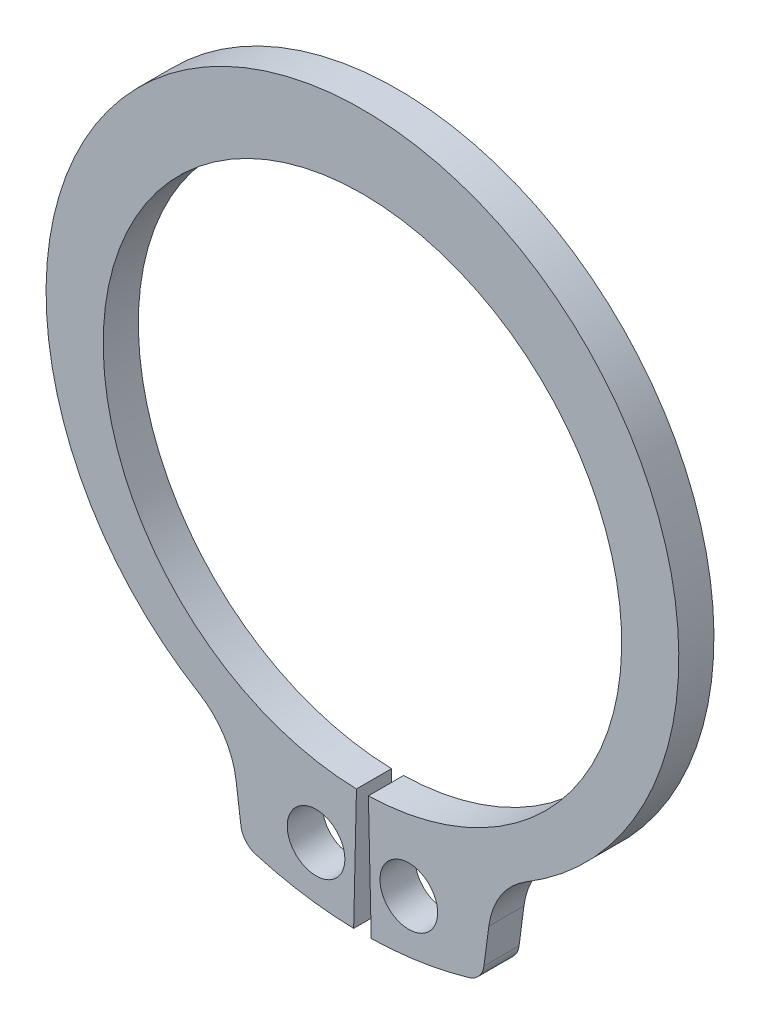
ISO-10303-21;
HEADER;
FILE_DESCRIPTION(('STEP AP214'),'2;1');
FILE_NAME('part.step','',(''),(''),'','','');
FILE_SCHEMA(('AUTOMOTIVE_DESIGN { 1 0 10303 214 1 1 1 1 }'));
ENDSEC;
DATA;
#1=APPLICATION_CONTEXT('core data for automotive mechanical design processes');
#2=APPLICATION_PROTOCOL_DEFINITION('international standard','automotive_design',2000,#1);
#3=PRODUCT_CONTEXT('',#1,'mechanical');
#4=PRODUCT('Part','Part','',(#3));
#5=PRODUCT_RELATED_PRODUCT_CATEGORY('part','',(#4));
#6=PRODUCT_DEFINITION_FORMATION('','',#4);
#7=PRODUCT_DEFINITION_CONTEXT('part definition',#1,'design');
#8=PRODUCT_DEFINITION('design','',#6,#7);
#9=PRODUCT_DEFINITION_SHAPE('','',#8);
#10=(LENGTH_UNIT() NAMED_UNIT(*) SI_UNIT(.MILLI.,.METRE.));
#11=(NAMED_UNIT(*) PLANE_ANGLE_UNIT() SI_UNIT($,.RADIAN.));
#12=(NAMED_UNIT(*) SI_UNIT($,.STERADIAN.) SOLID_ANGLE_UNIT());
#13=UNCERTAINTY_MEASURE_WITH_UNIT(LENGTH_MEASURE(1.E-05),#10,'distance_accuracy_value','');
#14=(GEOMETRIC_REPRESENTATION_CONTEXT(3) GLOBAL_UNCERTAINTY_ASSIGNED_CONTEXT((#13)) GLOBAL_UNIT_ASSIGNED_CONTEXT((#10,
#11,#12)) REPRESENTATION_CONTEXT('',''));
#15=CARTESIAN_POINT('',(0.,0.,0.));
#16=DIRECTION('',(0.,0.,1.));
#17=DIRECTION('',(1.,0.,0.));
#18=AXIS2_PLACEMENT_3D('',#15,#16,#17);
#19=CARTESIAN_POINT('',(0.,0.,-0.635));
#20=DIRECTION('',(0.,0.,1.));
#21=DIRECTION('',(1.,0.,0.));
#22=AXIS2_PLACEMENT_3D('',#19,#20,#21);
#23=CYLINDRICAL_SURFACE('',#22,4.6863);
#24=CARTESIAN_POINT('',(0.,0.,0.));
#25=DIRECTION('',(0.,0.,-1.));
#26=DIRECTION('',(1.,0.,0.));
#27=AXIS2_PLACEMENT_3D('',#24,#25,#26);
#28=CIRCLE('',#27,4.6863);
#29=CARTESIAN_POINT('',(-0.107879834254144,-4.68505812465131,0.));
#30=VERTEX_POINT('',#29);
#31=CARTESIAN_POINT('',(0.107879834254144,-4.68505812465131,0.));
#32=VERTEX_POINT('',#31);
#33=EDGE_CURVE('E151',#30,#32,#28,.T.);
#34=ORIENTED_EDGE('',*,*,#33,.F.);
#35=DIRECTION('',(0.,0.,1.));
#36=VECTOR('',#35,1.);
#37=CARTESIAN_POINT('',(-0.107879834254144,-4.68505812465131,-0.635));
#38=LINE('',#37,#36);
#39=CARTESIAN_POINT('',(-0.107879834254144,-4.68505812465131,-0.635));
#40=VERTEX_POINT('',#39);
#41=EDGE_CURVE('E11',#40,#30,#38,.T.);
#42=ORIENTED_EDGE('',*,*,#41,.F.);
#43=CARTESIAN_POINT('',(0.,0.,-0.635));
#44=DIRECTION('',(0.,0.,-1.));
#45=DIRECTION('',(1.,0.,0.));
#46=AXIS2_PLACEMENT_3D('',#43,#44,#45);
#47=CIRCLE('',#46,4.6863);
#48=CARTESIAN_POINT('',(0.107879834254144,-4.68505812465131,-0.635));
#49=VERTEX_POINT('',#48);
#50=EDGE_CURVE('E184',#40,#49,#47,.T.);
#51=ORIENTED_EDGE('',*,*,#50,.T.);
#52=DIRECTION('',(0.,0.,1.));
#53=VECTOR('',#52,1.);
#54=CARTESIAN_POINT('',(0.107879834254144,-4.68505812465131,-0.635));
#55=LINE('',#54,#53);
#56=EDGE_CURVE('E33',#49,#32,#55,.T.);
#57=ORIENTED_EDGE('',*,*,#56,.T.);
#58=EDGE_LOOP('',(#34,#42,#51,#57));
#59=FACE_BOUND('',#58,.T.);
#60=ADVANCED_FACE('F30',(#59),#23,.F.);
#61=CARTESIAN_POINT('',(-0.107879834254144,-4.68505812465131,-0.635));
#62=DIRECTION('',(0.999734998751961,-0.0230202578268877,0.));
#63=DIRECTION('',(0.0230202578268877,0.999734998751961,0.));
#64=AXIS2_PLACEMENT_3D('',#61,#62,#63);
#65=PLANE('',#64);
#66=DIRECTION('',(0.0230202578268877,0.999734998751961,0.));
#67=VECTOR('',#66,1.);
#68=CARTESIAN_POINT('',(-0.107879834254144,-4.68505812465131,0.));
#69=LINE('',#68,#67);
#70=CARTESIAN_POINT('',(-0.15875,-6.8942725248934,0.));
#71=VERTEX_POINT('',#70);
#72=EDGE_CURVE('E182',#71,#30,#69,.T.);
#73=ORIENTED_EDGE('',*,*,#72,.F.);
#74=DIRECTION('',(0.,0.,1.));
#75=VECTOR('',#74,1.);
#76=CARTESIAN_POINT('',(-0.15875,-6.8942725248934,-0.635));
#77=LINE('',#76,#75);
#78=CARTESIAN_POINT('',(-0.15875,-6.8942725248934,-0.635));
#79=VERTEX_POINT('',#78);
#80=EDGE_CURVE('E39',#79,#71,#77,.T.);
#81=ORIENTED_EDGE('',*,*,#80,.F.);
#82=DIRECTION('',(0.0230202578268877,0.999734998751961,0.));
#83=VECTOR('',#82,1.);
#84=CARTESIAN_POINT('',(-0.107879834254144,-4.68505812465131,-0.635));
#85=LINE('',#84,#83);
#86=EDGE_CURVE('E141',#79,#40,#85,.T.);
#87=ORIENTED_EDGE('',*,*,#86,.T.);
#88=ORIENTED_EDGE('',*,*,#41,.T.);
#89=EDGE_LOOP('',(#73,#81,#87,#88));
#90=FACE_BOUND('',#89,.T.);
#91=ADVANCED_FACE('F204',(#90),#65,.T.);
#92=CARTESIAN_POINT('',(0.,0.,-0.635));
#93=DIRECTION('',(0.,0.,1.));
#94=DIRECTION('',(1.,0.,0.));
#95=AXIS2_PLACEMENT_3D('',#92,#93,#94);
#96=CYLINDRICAL_SURFACE('',#95,6.8961);
#97=CARTESIAN_POINT('',(0.,0.,0.));
#98=DIRECTION('',(0.,0.,1.));
#99=DIRECTION('',(1.,0.,0.));
#100=AXIS2_PLACEMENT_3D('',#97,#98,#99);
#101=CIRCLE('',#100,6.8961);
#102=CARTESIAN_POINT('',(-1.92531317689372,-6.62188525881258,0.));
#103=VERTEX_POINT('',#102);
#104=EDGE_CURVE('E128',#103,#71,#101,.T.);
#105=ORIENTED_EDGE('',*,*,#104,.F.);
#106=DIRECTION('',(0.,0.,1.));
#107=VECTOR('',#106,1.);
#108=CARTESIAN_POINT('',(-1.92531317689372,-6.62188525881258,-0.635));
#109=LINE('',#108,#107);
#110=CARTESIAN_POINT('',(-1.92531317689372,-6.62188525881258,-0.635));
#111=VERTEX_POINT('',#110);
#112=EDGE_CURVE('E123',#111,#103,#109,.T.);
#113=ORIENTED_EDGE('',*,*,#112,.F.);
#114=CARTESIAN_POINT('',(0.,0.,-0.635));
#115=DIRECTION('',(0.,0.,1.));
#116=DIRECTION('',(1.,0.,0.));
#117=AXIS2_PLACEMENT_3D('',#114,#115,#116);
#118=CIRCLE('',#117,6.8961);
#119=EDGE_CURVE('E126',#111,#79,#118,.T.);
#120=ORIENTED_EDGE('',*,*,#119,.T.);
#121=ORIENTED_EDGE('',*,*,#80,.T.);
#122=EDGE_LOOP('',(#105,#113,#120,#121));
#123=FACE_BOUND('',#122,.T.);
#124=ADVANCED_FACE('F125',(#123),#96,.T.);
#125=CARTESIAN_POINT('',(-1.81894228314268,-6.25603524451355,-0.635));
#126=DIRECTION('',(0.,0.,1.));
#127=DIRECTION('',(1.,0.,0.));
#128=AXIS2_PLACEMENT_3D('',#125,#126,#127);
#129=CYLINDRICAL_SURFACE('',#128,0.381);
#130=CARTESIAN_POINT('',(-1.81894228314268,-6.25603524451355,0.));
#131=DIRECTION('',(0.,0.,1.));
#132=DIRECTION('',(1.,0.,0.));
#133=AXIS2_PLACEMENT_3D('',#130,#131,#132);
#134=CIRCLE('',#133,0.381);
#135=CARTESIAN_POINT('',(-2.1966827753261,-6.30576572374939,0.));
#136=VERTEX_POINT('',#135);
#137=EDGE_CURVE('E179',#136,#103,#134,.T.);
#138=ORIENTED_EDGE('',*,*,#137,.F.);
#139=DIRECTION('',(0.,0.,1.));
#140=VECTOR('',#139,1.);
#141=CARTESIAN_POINT('',(-2.1966827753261,-6.30576572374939,-0.635));
#142=LINE('',#141,#140);
#143=CARTESIAN_POINT('',(-2.1966827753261,-6.30576572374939,-0.635));
#144=VERTEX_POINT('',#143);
#145=EDGE_CURVE('E133',#144,#136,#142,.T.);
#146=ORIENTED_EDGE('',*,*,#145,.F.);
#147=CARTESIAN_POINT('',(-1.81894228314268,-6.25603524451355,-0.635));
#148=DIRECTION('',(0.,0.,1.));
#149=DIRECTION('',(1.,0.,0.));
#150=AXIS2_PLACEMENT_3D('',#147,#148,#149);
#151=CIRCLE('',#150,0.381);
#152=EDGE_CURVE('E139',#144,#111,#151,.T.);
#153=ORIENTED_EDGE('',*,*,#152,.T.);
#154=ORIENTED_EDGE('',*,*,#112,.T.);
#155=EDGE_LOOP('',(#138,#146,#153,#154));
#156=FACE_BOUND('',#155,.T.);
#157=ADVANCED_FACE('F143',(#156),#129,.T.);
#158=CARTESIAN_POINT('',(-2.28468093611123,-5.63735333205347,-0.635));
#159=DIRECTION('',(-0.99144486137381,-0.130526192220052,0.));
#160=DIRECTION('',(0.130526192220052,-0.99144486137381,0.));
#161=AXIS2_PLACEMENT_3D('',#158,#159,#160);
#162=PLANE('',#161);
#163=DIRECTION('',(0.130526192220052,-0.99144486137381,0.));
#164=VECTOR('',#163,1.);
#165=CARTESIAN_POINT('',(-2.28468093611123,-5.63735333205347,0.));
#166=LINE('',#165,#164);
#167=CARTESIAN_POINT('',(-2.28468093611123,-5.63735333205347,0.));
#168=VERTEX_POINT('',#167);
#169=EDGE_CURVE('E176',#168,#136,#166,.T.);
#170=ORIENTED_EDGE('',*,*,#169,.F.);
#171=DIRECTION('',(0.,0.,1.));
#172=VECTOR('',#171,1.);
#173=CARTESIAN_POINT('',(-2.28468093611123,-5.63735333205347,-0.635));
#174=LINE('',#173,#172);
#175=CARTESIAN_POINT('',(-2.28468093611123,-5.63735333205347,-0.635));
#176=VERTEX_POINT('',#175);
#177=EDGE_CURVE('E188',#176,#168,#174,.T.);
#178=ORIENTED_EDGE('',*,*,#177,.F.);
#179=DIRECTION('',(0.130526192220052,-0.99144486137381,0.));
#180=VECTOR('',#179,1.);
#181=CARTESIAN_POINT('',(-2.28468093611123,-5.63735333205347,-0.635));
#182=LINE('',#181,#180);
#183=EDGE_CURVE('E144',#176,#144,#182,.T.);
#184=ORIENTED_EDGE('',*,*,#183,.T.);
#185=ORIENTED_EDGE('',*,*,#145,.T.);
#186=EDGE_LOOP('',(#170,#178,#184,#185));
#187=FACE_BOUND('',#186,.T.);
#188=ADVANCED_FACE('F217',(#187),#162,.T.);
#189=CARTESIAN_POINT('',(-3.69450081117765,-5.82295963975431,-0.635));
#190=DIRECTION('',(0.,0.,1.));
#191=DIRECTION('',(1.,0.,0.));
#192=AXIS2_PLACEMENT_3D('',#189,#190,#191);
#193=CYLINDRICAL_SURFACE('',#192,1.42198515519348);
#194=CARTESIAN_POINT('',(-3.69450081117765,-5.82295963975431,0.));
#195=DIRECTION('',(0.,0.,-1.));
#196=DIRECTION('',(1.,0.,0.));
#197=AXIS2_PLACEMENT_3D('',#194,#195,#196);
#198=CIRCLE('',#197,1.42198515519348);
#199=CARTESIAN_POINT('',(-2.95881724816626,-4.60607366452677,0.));
#200=VERTEX_POINT('',#199);
#201=EDGE_CURVE('E173',#200,#168,#198,.T.);
#202=ORIENTED_EDGE('',*,*,#201,.F.);
#203=DIRECTION('',(0.,0.,1.));
#204=VECTOR('',#203,1.);
#205=CARTESIAN_POINT('',(-2.95881724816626,-4.60607366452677,-0.635));
#206=LINE('',#205,#204);
#207=CARTESIAN_POINT('',(-2.95881724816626,-4.60607366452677,-0.635));
#208=VERTEX_POINT('',#207);
#209=EDGE_CURVE('E190',#208,#200,#206,.T.);
#210=ORIENTED_EDGE('',*,*,#209,.F.);
#211=CARTESIAN_POINT('',(-3.69450081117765,-5.82295963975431,-0.635));
#212=DIRECTION('',(0.,0.,-1.));
#213=DIRECTION('',(1.,0.,0.));
#214=AXIS2_PLACEMENT_3D('',#211,#212,#213);
#215=CIRCLE('',#214,1.42198515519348);
#216=EDGE_CURVE('E146',#208,#176,#215,.T.);
#217=ORIENTED_EDGE('',*,*,#216,.T.);
#218=ORIENTED_EDGE('',*,*,#177,.T.);
#219=EDGE_LOOP('',(#202,#210,#217,#218));
#220=FACE_BOUND('',#219,.T.);
#221=ADVANCED_FACE('F220',(#220),#193,.F.);
#222=CARTESIAN_POINT('',(0.,0.288072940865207,-0.635));
#223=DIRECTION('',(0.,0.,1.));
#224=DIRECTION('',(1.,0.,0.));
#225=AXIS2_PLACEMENT_3D('',#222,#223,#224);
#226=CYLINDRICAL_SURFACE('',#225,5.71902705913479);
#227=CARTESIAN_POINT('',(0.,0.288072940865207,0.));
#228=DIRECTION('',(0.,0.,1.));
#229=DIRECTION('',(1.,0.,0.));
#230=AXIS2_PLACEMENT_3D('',#227,#228,#229);
#231=CIRCLE('',#230,5.71902705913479);
#232=CARTESIAN_POINT('',(2.95881724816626,-4.60607366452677,0.));
#233=VERTEX_POINT('',#232);
#234=EDGE_CURVE('E170',#233,#200,#231,.T.);
#235=ORIENTED_EDGE('',*,*,#234,.F.);
#236=DIRECTION('',(0.,0.,1.));
#237=VECTOR('',#236,1.);
#238=CARTESIAN_POINT('',(2.95881724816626,-4.60607366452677,-0.635));
#239=LINE('',#238,#237);
#240=CARTESIAN_POINT('',(2.95881724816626,-4.60607366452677,-0.635));
#241=VERTEX_POINT('',#240);
#242=EDGE_CURVE('E192',#241,#233,#239,.T.);
#243=ORIENTED_EDGE('',*,*,#242,.F.);
#244=CARTESIAN_POINT('',(0.,0.288072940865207,-0.635));
#245=DIRECTION('',(0.,0.,1.));
#246=DIRECTION('',(1.,0.,0.));
#247=AXIS2_PLACEMENT_3D('',#244,#245,#246);
#248=CIRCLE('',#247,5.71902705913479);
#249=EDGE_CURVE('E294',#241,#208,#248,.T.);
#250=ORIENTED_EDGE('',*,*,#249,.T.);
#251=ORIENTED_EDGE('',*,*,#209,.T.);
#252=EDGE_LOOP('',(#235,#243,#250,#251));
#253=FACE_BOUND('',#252,.T.);
#254=ADVANCED_FACE('F224',(#253),#226,.T.);
#255=CARTESIAN_POINT('',(3.69450081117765,-5.82295963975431,-0.635));
#256=DIRECTION('',(0.,0.,1.));
#257=DIRECTION('',(1.,0.,0.));
#258=AXIS2_PLACEMENT_3D('',#255,#256,#257);
#259=CYLINDRICAL_SURFACE('',#258,1.42198515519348);
#260=CARTESIAN_POINT('',(3.69450081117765,-5.82295963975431,0.));
#261=DIRECTION('',(0.,0.,-1.));
#262=DIRECTION('',(1.,0.,0.));
#263=AXIS2_PLACEMENT_3D('',#260,#261,#262);
#264=CIRCLE('',#263,1.42198515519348);
#265=CARTESIAN_POINT('',(2.28468093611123,-5.63735333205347,0.));
#266=VERTEX_POINT('',#265);
#267=EDGE_CURVE('E167',#266,#233,#264,.T.);
#268=ORIENTED_EDGE('',*,*,#267,.F.);
#269=DIRECTION('',(0.,0.,1.));
#270=VECTOR('',#269,1.);
#271=CARTESIAN_POINT('',(2.28468093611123,-5.63735333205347,-0.635));
#272=LINE('',#271,#270);
#273=CARTESIAN_POINT('',(2.28468093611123,-5.63735333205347,-0.635));
#274=VERTEX_POINT('',#273);
#275=EDGE_CURVE('E194',#274,#266,#272,.T.);
#276=ORIENTED_EDGE('',*,*,#275,.F.);
#277=CARTESIAN_POINT('',(3.69450081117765,-5.82295963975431,-0.635));
#278=DIRECTION('',(0.,0.,-1.));
#279=DIRECTION('',(1.,0.,0.));
#280=AXIS2_PLACEMENT_3D('',#277,#278,#279);
#281=CIRCLE('',#280,1.42198515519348);
#282=EDGE_CURVE('E291',#274,#241,#281,.T.);
#283=ORIENTED_EDGE('',*,*,#282,.T.);
#284=ORIENTED_EDGE('',*,*,#242,.T.);
#285=EDGE_LOOP('',(#268,#276,#283,#284));
#286=FACE_BOUND('',#285,.T.);
#287=ADVANCED_FACE('F228',(#286),#259,.F.);
#288=CARTESIAN_POINT('',(2.28468093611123,-5.63735333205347,-0.635));
#289=DIRECTION('',(0.99144486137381,-0.130526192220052,0.));
#290=DIRECTION('',(0.130526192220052,0.99144486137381,0.));
#291=AXIS2_PLACEMENT_3D('',#288,#289,#290);
#292=PLANE('',#291);
#293=DIRECTION('',(0.130526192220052,0.99144486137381,0.));
#294=VECTOR('',#293,1.);
#295=CARTESIAN_POINT('',(2.28468093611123,-5.63735333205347,0.));
#296=LINE('',#295,#294);
#297=CARTESIAN_POINT('',(2.1966827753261,-6.30576572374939,0.));
#298=VERTEX_POINT('',#297);
#299=EDGE_CURVE('E164',#298,#266,#296,.T.);
#300=ORIENTED_EDGE('',*,*,#299,.F.);
#301=DIRECTION('',(0.,0.,1.));
#302=VECTOR('',#301,1.);
#303=CARTESIAN_POINT('',(2.1966827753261,-6.30576572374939,-0.635));
#304=LINE('',#303,#302);
#305=CARTESIAN_POINT('',(2.1966827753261,-6.30576572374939,-0.635));
#306=VERTEX_POINT('',#305);
#307=EDGE_CURVE('E196',#306,#298,#304,.T.);
#308=ORIENTED_EDGE('',*,*,#307,.F.);
#309=DIRECTION('',(0.130526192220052,0.99144486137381,0.));
#310=VECTOR('',#309,1.);
#311=CARTESIAN_POINT('',(2.28468093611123,-5.63735333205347,-0.635));
#312=LINE('',#311,#310);
#313=EDGE_CURVE('E288',#306,#274,#312,.T.);
#314=ORIENTED_EDGE('',*,*,#313,.T.);
#315=ORIENTED_EDGE('',*,*,#275,.T.);
#316=EDGE_LOOP('',(#300,#308,#314,#315));
#317=FACE_BOUND('',#316,.T.);
#318=ADVANCED_FACE('F232',(#317),#292,.T.);
#319=CARTESIAN_POINT('',(1.81894228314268,-6.25603524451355,-0.635));
#320=DIRECTION('',(0.,0.,1.));
#321=DIRECTION('',(1.,0.,0.));
#322=AXIS2_PLACEMENT_3D('',#319,#320,#321);
#323=CYLINDRICAL_SURFACE('',#322,0.381);
#324=CARTESIAN_POINT('',(1.81894228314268,-6.25603524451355,0.));
#325=DIRECTION('',(0.,0.,1.));
#326=DIRECTION('',(-1.,0.,0.));
#327=AXIS2_PLACEMENT_3D('',#324,#325,#326);
#328=CIRCLE('',#327,0.381);
#329=CARTESIAN_POINT('',(1.92531317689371,-6.62188525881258,0.));
#330=VERTEX_POINT('',#329);
#331=EDGE_CURVE('E161',#330,#298,#328,.T.);
#332=ORIENTED_EDGE('',*,*,#331,.F.);
#333=DIRECTION('',(0.,0.,1.));
#334=VECTOR('',#333,1.);
#335=CARTESIAN_POINT('',(1.92531317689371,-6.62188525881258,-0.635));
#336=LINE('',#335,#334);
#337=CARTESIAN_POINT('',(1.92531317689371,-6.62188525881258,-0.635));
#338=VERTEX_POINT('',#337);
#339=EDGE_CURVE('E198',#338,#330,#336,.T.);
#340=ORIENTED_EDGE('',*,*,#339,.F.);
#341=CARTESIAN_POINT('',(1.81894228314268,-6.25603524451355,-0.635));
#342=DIRECTION('',(0.,0.,1.));
#343=DIRECTION('',(-1.,0.,0.));
#344=AXIS2_PLACEMENT_3D('',#341,#342,#343);
#345=CIRCLE('',#344,0.381);
#346=EDGE_CURVE('E285',#338,#306,#345,.T.);
#347=ORIENTED_EDGE('',*,*,#346,.T.);
#348=ORIENTED_EDGE('',*,*,#307,.T.);
#349=EDGE_LOOP('',(#332,#340,#347,#348));
#350=FACE_BOUND('',#349,.T.);
#351=ADVANCED_FACE('F236',(#350),#323,.T.);
#352=CARTESIAN_POINT('',(0.,0.,-0.635));
#353=DIRECTION('',(0.,0.,1.));
#354=DIRECTION('',(1.,0.,0.));
#355=AXIS2_PLACEMENT_3D('',#352,#353,#354);
#356=CYLINDRICAL_SURFACE('',#355,6.8961);
#357=CARTESIAN_POINT('',(0.,0.,0.));
#358=DIRECTION('',(0.,0.,1.));
#359=DIRECTION('',(1.,0.,0.));
#360=AXIS2_PLACEMENT_3D('',#357,#358,#359);
#361=CIRCLE('',#360,6.8961);
#362=CARTESIAN_POINT('',(0.158749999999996,-6.8942725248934,0.));
#363=VERTEX_POINT('',#362);
#364=EDGE_CURVE('E158',#363,#330,#361,.T.);
#365=ORIENTED_EDGE('',*,*,#364,.F.);
#366=DIRECTION('',(0.,0.,1.));
#367=VECTOR('',#366,1.);
#368=CARTESIAN_POINT('',(0.158749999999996,-6.8942725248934,-0.635));
#369=LINE('',#368,#367);
#370=CARTESIAN_POINT('',(0.158749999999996,-6.8942725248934,-0.635));
#371=VERTEX_POINT('',#370);
#372=EDGE_CURVE('E199',#371,#363,#369,.T.);
#373=ORIENTED_EDGE('',*,*,#372,.F.);
#374=CARTESIAN_POINT('',(0.,0.,-0.635));
#375=DIRECTION('',(0.,0.,1.));
#376=DIRECTION('',(1.,0.,0.));
#377=AXIS2_PLACEMENT_3D('',#374,#375,#376);
#378=CIRCLE('',#377,6.8961);
#379=EDGE_CURVE('E282',#371,#338,#378,.T.);
#380=ORIENTED_EDGE('',*,*,#379,.T.);
#381=ORIENTED_EDGE('',*,*,#339,.T.);
#382=EDGE_LOOP('',(#365,#373,#380,#381));
#383=FACE_BOUND('',#382,.T.);
#384=ADVANCED_FACE('F240',(#383),#356,.T.);
#385=CARTESIAN_POINT('',(0.107879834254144,-4.68505812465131,-0.635));
#386=DIRECTION('',(-0.999734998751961,-0.0230202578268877,0.));
#387=DIRECTION('',(0.0230202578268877,-0.999734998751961,0.));
#388=AXIS2_PLACEMENT_3D('',#385,#386,#387);
#389=PLANE('',#388);
#390=DIRECTION('',(0.0230202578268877,-0.999734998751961,0.));
#391=VECTOR('',#390,1.);
#392=CARTESIAN_POINT('',(0.107879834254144,-4.68505812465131,0.));
#393=LINE('',#392,#391);
#394=EDGE_CURVE('E154',#32,#363,#393,.T.);
#395=ORIENTED_EDGE('',*,*,#394,.F.);
#396=ORIENTED_EDGE('',*,*,#56,.F.);
#397=DIRECTION('',(0.0230202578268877,-0.999734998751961,0.));
#398=VECTOR('',#397,1.);
#399=CARTESIAN_POINT('',(0.107879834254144,-4.68505812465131,-0.635));
#400=LINE('',#399,#398);
#401=EDGE_CURVE('E280',#49,#371,#400,.T.);
#402=ORIENTED_EDGE('',*,*,#401,.T.);
#403=ORIENTED_EDGE('',*,*,#372,.T.);
#404=EDGE_LOOP('',(#395,#396,#402,#403));
#405=FACE_BOUND('',#404,.T.);
#406=ADVANCED_FACE('F201',(#405),#389,.T.);
#407=CARTESIAN_POINT('',(0.,0.,-0.635));
#408=DIRECTION('',(0.,0.,1.));
#409=DIRECTION('',(1.,0.,0.));
#410=AXIS2_PLACEMENT_3D('',#407,#408,#409);
#411=PLANE('',#410);
#412=CARTESIAN_POINT('',(-0.8382,-5.89061336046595,-0.635));
#413=DIRECTION('',(0.,0.,1.));
#414=DIRECTION('',(1.,0.,0.));
#415=AXIS2_PLACEMENT_3D('',#412,#413,#414);
#416=CIRCLE('',#415,0.5207);
#417=CARTESIAN_POINT('',(-0.3175,-5.89061336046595,-0.635));
#418=VERTEX_POINT('',#417);
#419=EDGE_CURVE('E267',#418,#418,#416,.T.);
#420=ORIENTED_EDGE('',*,*,#419,.T.);
#421=EDGE_LOOP('',(#420));
#422=FACE_BOUND('',#421,.T.);
#423=CARTESIAN_POINT('',(0.8382,-5.89061336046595,-0.635));
#424=DIRECTION('',(0.,0.,1.));
#425=DIRECTION('',(1.,0.,0.));
#426=AXIS2_PLACEMENT_3D('',#423,#424,#425);
#427=CIRCLE('',#426,0.5207);
#428=CARTESIAN_POINT('',(1.3589,-5.89061336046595,-0.635));
#429=VERTEX_POINT('',#428);
#430=EDGE_CURVE('E155',#429,#429,#427,.T.);
#431=ORIENTED_EDGE('',*,*,#430,.T.);
#432=EDGE_LOOP('',(#431));
#433=FACE_BOUND('',#432,.T.);
#434=ORIENTED_EDGE('',*,*,#50,.F.);
#435=ORIENTED_EDGE('',*,*,#86,.F.);
#436=ORIENTED_EDGE('',*,*,#119,.F.);
#437=ORIENTED_EDGE('',*,*,#152,.F.);
#438=ORIENTED_EDGE('',*,*,#183,.F.);
#439=ORIENTED_EDGE('',*,*,#216,.F.);
#440=ORIENTED_EDGE('',*,*,#249,.F.);
#441=ORIENTED_EDGE('',*,*,#282,.F.);
#442=ORIENTED_EDGE('',*,*,#313,.F.);
#443=ORIENTED_EDGE('',*,*,#346,.F.);
#444=ORIENTED_EDGE('',*,*,#379,.F.);
#445=ORIENTED_EDGE('',*,*,#401,.F.);
#446=EDGE_LOOP('',(#434,#435,#436,#437,#438,#439,#440,#441,#442,#443,#444,#445));
#447=FACE_BOUND('',#446,.T.);
#448=ADVANCED_FACE('F137',(#422,#433,#447),#411,.F.);
#449=CARTESIAN_POINT('',(0.,0.,0.));
#450=DIRECTION('',(0.,0.,1.));
#451=DIRECTION('',(1.,0.,0.));
#452=AXIS2_PLACEMENT_3D('',#449,#450,#451);
#453=PLANE('',#452);
#454=CARTESIAN_POINT('',(-0.8382,-5.89061336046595,0.));
#455=DIRECTION('',(0.,0.,1.));
#456=DIRECTION('',(1.,0.,0.));
#457=AXIS2_PLACEMENT_3D('',#454,#455,#456);
#458=CIRCLE('',#457,0.5207);
#459=CARTESIAN_POINT('',(-0.3175,-5.89061336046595,0.));
#460=VERTEX_POINT('',#459);
#461=EDGE_CURVE('E270',#460,#460,#458,.T.);
#462=ORIENTED_EDGE('',*,*,#461,.F.);
#463=EDGE_LOOP('',(#462));
#464=FACE_BOUND('',#463,.T.);
#465=CARTESIAN_POINT('',(0.8382,-5.89061336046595,0.));
#466=DIRECTION('',(0.,0.,1.));
#467=DIRECTION('',(1.,0.,0.));
#468=AXIS2_PLACEMENT_3D('',#465,#466,#467);
#469=CIRCLE('',#468,0.5207);
#470=CARTESIAN_POINT('',(1.3589,-5.89061336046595,0.));
#471=VERTEX_POINT('',#470);
#472=EDGE_CURVE('E272',#471,#471,#469,.T.);
#473=ORIENTED_EDGE('',*,*,#472,.F.);
#474=EDGE_LOOP('',(#473));
#475=FACE_BOUND('',#474,.T.);
#476=ORIENTED_EDGE('',*,*,#33,.T.);
#477=ORIENTED_EDGE('',*,*,#394,.T.);
#478=ORIENTED_EDGE('',*,*,#364,.T.);
#479=ORIENTED_EDGE('',*,*,#331,.T.);
#480=ORIENTED_EDGE('',*,*,#299,.T.);
#481=ORIENTED_EDGE('',*,*,#267,.T.);
#482=ORIENTED_EDGE('',*,*,#234,.T.);
#483=ORIENTED_EDGE('',*,*,#201,.T.);
#484=ORIENTED_EDGE('',*,*,#169,.T.);
#485=ORIENTED_EDGE('',*,*,#137,.T.);
#486=ORIENTED_EDGE('',*,*,#104,.T.);
#487=ORIENTED_EDGE('',*,*,#72,.T.);
#488=EDGE_LOOP('',(#476,#477,#478,#479,#480,#481,#482,#483,#484,#485,#486,#487));
#489=FACE_BOUND('',#488,.T.);
#490=ADVANCED_FACE('F203',(#464,#475,#489),#453,.T.);
#491=CARTESIAN_POINT('',(0.8382,-5.89061336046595,-0.635));
#492=DIRECTION('',(0.,0.,1.));
#493=DIRECTION('',(1.,0.,0.));
#494=AXIS2_PLACEMENT_3D('',#491,#492,#493);
#495=CYLINDRICAL_SURFACE('',#494,0.5207);
#496=ORIENTED_EDGE('',*,*,#430,.F.);
#497=EDGE_LOOP('',(#496));
#498=FACE_BOUND('',#497,.T.);
#499=ORIENTED_EDGE('',*,*,#472,.T.);
#500=EDGE_LOOP('',(#499));
#501=FACE_BOUND('',#500,.T.);
#502=ADVANCED_FACE('F252',(#498,#501),#495,.F.);
#503=CARTESIAN_POINT('',(-0.8382,-5.89061336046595,-0.635));
#504=DIRECTION('',(0.,0.,1.));
#505=DIRECTION('',(1.,0.,0.));
#506=AXIS2_PLACEMENT_3D('',#503,#504,#505);
#507=CYLINDRICAL_SURFACE('',#506,0.5207);
#508=ORIENTED_EDGE('',*,*,#419,.F.);
#509=EDGE_LOOP('',(#508));
#510=FACE_BOUND('',#509,.T.);
#511=ORIENTED_EDGE('',*,*,#461,.T.);
#512=EDGE_LOOP('',(#511));
#513=FACE_BOUND('',#512,.T.);
#514=ADVANCED_FACE('F259',(#510,#513),#507,.F.);
#515=CLOSED_SHELL('',(#60,#91,#124,#157,#188,#221,#254,#287,#318,#351,#384,#406,#448,#490,#502,#514));
#516=MANIFOLD_SOLID_BREP('B2',#515);
#517=ADVANCED_BREP_SHAPE_REPRESENTATION('',(#18,#516),#14);
#518=SHAPE_DEFINITION_REPRESENTATION(#9,#517);
ENDSEC;
END-ISO-10303-21;
